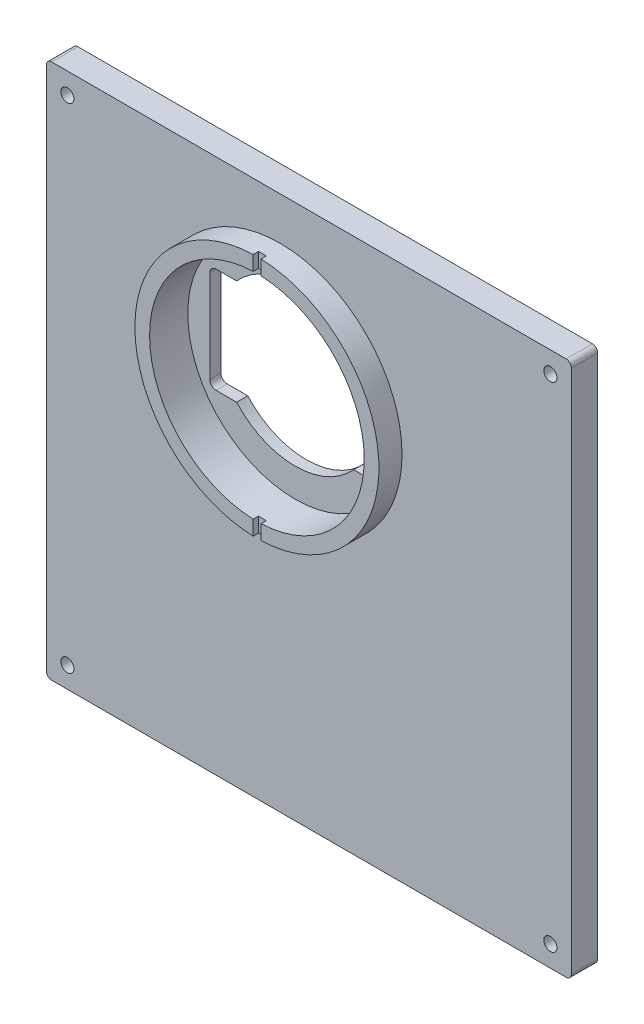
ISO-10303-21;
HEADER;
FILE_DESCRIPTION(('STEP AP214'),'2;1');
FILE_NAME('part.step','',(''),(''),'','','');
FILE_SCHEMA(('AUTOMOTIVE_DESIGN { 1 0 10303 214 1 1 1 1 }'));
ENDSEC;
DATA;
#1=APPLICATION_CONTEXT('core data for automotive mechanical design processes');
#2=APPLICATION_PROTOCOL_DEFINITION('international standard','automotive_design',2000,#1);
#3=PRODUCT_CONTEXT('',#1,'mechanical');
#4=PRODUCT('Part','Part','',(#3));
#5=PRODUCT_RELATED_PRODUCT_CATEGORY('part','',(#4));
#6=PRODUCT_DEFINITION_FORMATION('','',#4);
#7=PRODUCT_DEFINITION_CONTEXT('part definition',#1,'design');
#8=PRODUCT_DEFINITION('design','',#6,#7);
#9=PRODUCT_DEFINITION_SHAPE('','',#8);
#10=(LENGTH_UNIT() NAMED_UNIT(*) SI_UNIT(.MILLI.,.METRE.));
#11=(NAMED_UNIT(*) PLANE_ANGLE_UNIT() SI_UNIT($,.RADIAN.));
#12=(NAMED_UNIT(*) SI_UNIT($,.STERADIAN.) SOLID_ANGLE_UNIT());
#13=UNCERTAINTY_MEASURE_WITH_UNIT(LENGTH_MEASURE(1.E-05),#10,'distance_accuracy_value','');
#14=(GEOMETRIC_REPRESENTATION_CONTEXT(3) GLOBAL_UNCERTAINTY_ASSIGNED_CONTEXT((#13)) GLOBAL_UNIT_ASSIGNED_CONTEXT((#10,
#11,#12)) REPRESENTATION_CONTEXT('',''));
#15=CARTESIAN_POINT('',(0.,0.,0.));
#16=DIRECTION('',(0.,0.,1.));
#17=DIRECTION('',(1.,0.,0.));
#18=AXIS2_PLACEMENT_3D('',#15,#16,#17);
#19=CARTESIAN_POINT('',(0.,0.,11.938));
#20=DIRECTION('',(0.,0.,1.));
#21=DIRECTION('',(1.,0.,0.));
#22=AXIS2_PLACEMENT_3D('',#19,#20,#21);
#23=PLANE('',#22);
#24=DIRECTION('',(0.,1.,0.));
#25=VECTOR('',#24,1.);
#26=CARTESIAN_POINT('',(1.016,-34.114249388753,11.938));
#27=LINE('',#26,#25);
#28=CARTESIAN_POINT('',(1.016,-29.4973077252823,11.938));
#29=VERTEX_POINT('',#28);
#30=CARTESIAN_POINT('',(1.016,-25.9389097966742,11.938));
#31=VERTEX_POINT('',#30);
#32=EDGE_CURVE('E346',#29,#31,#27,.T.);
#33=ORIENTED_EDGE('',*,*,#32,.F.);
#34=CARTESIAN_POINT('',(0.,0.,11.938));
#35=DIRECTION('',(0.,0.,1.));
#36=DIRECTION('',(1.,0.,0.));
#37=AXIS2_PLACEMENT_3D('',#34,#35,#36);
#38=CIRCLE('',#37,29.5148);
#39=CARTESIAN_POINT('',(1.016,29.4973077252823,11.938));
#40=VERTEX_POINT('',#39);
#41=EDGE_CURVE('E242',#29,#40,#38,.T.);
#42=ORIENTED_EDGE('',*,*,#41,.T.);
#43=CARTESIAN_POINT('',(1.016,25.9389097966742,11.938));
#44=VERTEX_POINT('',#43);
#45=EDGE_CURVE('E234',#44,#40,#27,.T.);
#46=ORIENTED_EDGE('',*,*,#45,.F.);
#47=CARTESIAN_POINT('',(0.,0.,11.938));
#48=DIRECTION('',(0.,0.,1.));
#49=DIRECTION('',(1.,0.,0.));
#50=AXIS2_PLACEMENT_3D('',#47,#48,#49);
#51=CIRCLE('',#50,25.9588);
#52=EDGE_CURVE('E438',#31,#44,#51,.T.);
#53=ORIENTED_EDGE('',*,*,#52,.F.);
#54=EDGE_LOOP('',(#33,#42,#46,#53));
#55=FACE_BOUND('',#54,.T.);
#56=ADVANCED_FACE('F31',(#55),#23,.T.);
#57=CARTESIAN_POINT('',(0.,0.,0.));
#58=DIRECTION('',(0.,0.,1.));
#59=DIRECTION('',(1.,0.,0.));
#60=AXIS2_PLACEMENT_3D('',#57,#58,#59);
#61=CYLINDRICAL_SURFACE('',#60,19.0119);
#62=CARTESIAN_POINT('',(0.,0.,2.6924));
#63=DIRECTION('',(0.,0.,1.));
#64=DIRECTION('',(1.,0.,0.));
#65=AXIS2_PLACEMENT_3D('',#62,#63,#64);
#66=CIRCLE('',#65,19.0119);
#67=CARTESIAN_POINT('',(14.1478741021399,12.7,2.6924));
#68=VERTEX_POINT('',#67);
#69=CARTESIAN_POINT('',(-14.1478741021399,12.7,2.6924));
#70=VERTEX_POINT('',#69);
#71=EDGE_CURVE('E431',#68,#70,#66,.T.);
#72=ORIENTED_EDGE('',*,*,#71,.T.);
#73=DIRECTION('',(0.,0.,1.));
#74=VECTOR('',#73,1.);
#75=CARTESIAN_POINT('',(-14.1478741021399,12.7,0.));
#76=LINE('',#75,#74);
#77=CARTESIAN_POINT('',(-14.1478741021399,12.7,0.));
#78=VERTEX_POINT('',#77);
#79=EDGE_CURVE('E322',#70,#78,#76,.F.);
#80=ORIENTED_EDGE('',*,*,#79,.T.);
#81=CARTESIAN_POINT('',(0.,0.,0.));
#82=DIRECTION('',(0.,0.,1.));
#83=DIRECTION('',(1.,0.,0.));
#84=AXIS2_PLACEMENT_3D('',#81,#82,#83);
#85=CIRCLE('',#84,19.0119);
#86=CARTESIAN_POINT('',(14.1478741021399,12.7,0.));
#87=VERTEX_POINT('',#86);
#88=EDGE_CURVE('E435',#87,#78,#85,.T.);
#89=ORIENTED_EDGE('',*,*,#88,.F.);
#90=DIRECTION('',(0.,0.,1.));
#91=VECTOR('',#90,1.);
#92=CARTESIAN_POINT('',(14.1478741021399,12.7,0.));
#93=LINE('',#92,#91);
#94=EDGE_CURVE('E319',#87,#68,#93,.T.);
#95=ORIENTED_EDGE('',*,*,#94,.T.);
#96=EDGE_LOOP('',(#72,#80,#89,#95));
#97=FACE_BOUND('',#96,.T.);
#98=ADVANCED_FACE('F461',(#97),#61,.F.);
#99=CARTESIAN_POINT('',(-55.245,38.608,6.35));
#100=DIRECTION('',(0.,0.,-1.));
#101=DIRECTION('',(-1.,0.,0.));
#102=AXIS2_PLACEMENT_3D('',#99,#100,#101);
#103=CYLINDRICAL_SURFACE('',#102,1.27);
#104=DIRECTION('',(0.,0.,-1.));
#105=VECTOR('',#104,1.);
#106=CARTESIAN_POINT('',(-56.515,38.608,6.35));
#107=LINE('',#106,#105);
#108=CARTESIAN_POINT('',(-56.515,38.608,6.35));
#109=VERTEX_POINT('',#108);
#110=CARTESIAN_POINT('',(-56.515,38.608,0.));
#111=VERTEX_POINT('',#110);
#112=EDGE_CURVE('E311',#109,#111,#107,.T.);
#113=ORIENTED_EDGE('',*,*,#112,.F.);
#114=CARTESIAN_POINT('',(-55.245,38.608,6.35));
#115=DIRECTION('',(0.,0.,1.));
#116=DIRECTION('',(1.,0.,0.));
#117=AXIS2_PLACEMENT_3D('',#114,#115,#116);
#118=CIRCLE('',#117,1.27);
#119=CARTESIAN_POINT('',(-55.245,39.878,6.35));
#120=VERTEX_POINT('',#119);
#121=EDGE_CURVE('E273',#120,#109,#118,.T.);
#122=ORIENTED_EDGE('',*,*,#121,.F.);
#123=DIRECTION('',(0.,0.,-1.));
#124=VECTOR('',#123,1.);
#125=CARTESIAN_POINT('',(-55.245,39.878,6.35));
#126=LINE('',#125,#124);
#127=CARTESIAN_POINT('',(-55.245,39.878,0.));
#128=VERTEX_POINT('',#127);
#129=EDGE_CURVE('E297',#120,#128,#126,.T.);
#130=ORIENTED_EDGE('',*,*,#129,.T.);
#131=CARTESIAN_POINT('',(-55.245,38.608,0.));
#132=DIRECTION('',(0.,0.,1.));
#133=DIRECTION('',(1.,0.,0.));
#134=AXIS2_PLACEMENT_3D('',#131,#132,#133);
#135=CIRCLE('',#134,1.27);
#136=EDGE_CURVE('E241',#128,#111,#135,.T.);
#137=ORIENTED_EDGE('',*,*,#136,.T.);
#138=EDGE_LOOP('',(#113,#122,#130,#137));
#139=FACE_BOUND('',#138,.T.);
#140=ADVANCED_FACE('F466',(#139),#103,.T.);
#141=CARTESIAN_POINT('',(-56.515,38.608,6.35));
#142=DIRECTION('',(1.,0.,0.));
#143=DIRECTION('',(0.,1.,0.));
#144=AXIS2_PLACEMENT_3D('',#141,#142,#143);
#145=PLANE('',#144);
#146=DIRECTION('',(0.,0.,-1.));
#147=VECTOR('',#146,1.);
#148=CARTESIAN_POINT('',(-56.515,-88.392,6.35));
#149=LINE('',#148,#147);
#150=CARTESIAN_POINT('',(-56.515,-88.392,6.35));
#151=VERTEX_POINT('',#150);
#152=CARTESIAN_POINT('',(-56.515,-88.392,0.));
#153=VERTEX_POINT('',#152);
#154=EDGE_CURVE('E309',#151,#153,#149,.T.);
#155=ORIENTED_EDGE('',*,*,#154,.F.);
#156=DIRECTION('',(0.,-1.,0.));
#157=VECTOR('',#156,1.);
#158=CARTESIAN_POINT('',(-56.515,38.608,6.35));
#159=LINE('',#158,#157);
#160=EDGE_CURVE('E276',#109,#151,#159,.T.);
#161=ORIENTED_EDGE('',*,*,#160,.F.);
#162=ORIENTED_EDGE('',*,*,#112,.T.);
#163=DIRECTION('',(0.,-1.,0.));
#164=VECTOR('',#163,1.);
#165=CARTESIAN_POINT('',(-56.515,38.608,0.));
#166=LINE('',#165,#164);
#167=EDGE_CURVE('E245',#111,#153,#166,.T.);
#168=ORIENTED_EDGE('',*,*,#167,.T.);
#169=EDGE_LOOP('',(#155,#161,#162,#168));
#170=FACE_BOUND('',#169,.T.);
#171=ADVANCED_FACE('F33',(#170),#145,.F.);
#172=CARTESIAN_POINT('',(-55.245,-88.392,6.35));
#173=DIRECTION('',(0.,0.,-1.));
#174=DIRECTION('',(-1.,0.,0.));
#175=AXIS2_PLACEMENT_3D('',#172,#173,#174);
#176=CYLINDRICAL_SURFACE('',#175,1.26999999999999);
#177=DIRECTION('',(0.,0.,-1.));
#178=VECTOR('',#177,1.);
#179=CARTESIAN_POINT('',(-55.245,-89.662,6.35));
#180=LINE('',#179,#178);
#181=CARTESIAN_POINT('',(-55.245,-89.662,6.35));
#182=VERTEX_POINT('',#181);
#183=CARTESIAN_POINT('',(-55.245,-89.662,0.));
#184=VERTEX_POINT('',#183);
#185=EDGE_CURVE('E307',#182,#184,#180,.T.);
#186=ORIENTED_EDGE('',*,*,#185,.F.);
#187=CARTESIAN_POINT('',(-55.245,-88.392,6.35));
#188=DIRECTION('',(0.,0.,1.));
#189=DIRECTION('',(1.,0.,0.));
#190=AXIS2_PLACEMENT_3D('',#187,#188,#189);
#191=CIRCLE('',#190,1.26999999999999);
#192=EDGE_CURVE('E279',#151,#182,#191,.T.);
#193=ORIENTED_EDGE('',*,*,#192,.F.);
#194=ORIENTED_EDGE('',*,*,#154,.T.);
#195=CARTESIAN_POINT('',(-55.245,-88.392,0.));
#196=DIRECTION('',(0.,0.,1.));
#197=DIRECTION('',(1.,0.,0.));
#198=AXIS2_PLACEMENT_3D('',#195,#196,#197);
#199=CIRCLE('',#198,1.26999999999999);
#200=EDGE_CURVE('E255',#153,#184,#199,.T.);
#201=ORIENTED_EDGE('',*,*,#200,.T.);
#202=EDGE_LOOP('',(#186,#193,#194,#201));
#203=FACE_BOUND('',#202,.T.);
#204=ADVANCED_FACE('F513',(#203),#176,.T.);
#205=CARTESIAN_POINT('',(-55.245,-89.662,6.35));
#206=DIRECTION('',(0.,1.,0.));
#207=DIRECTION('',(-1.,0.,0.));
#208=AXIS2_PLACEMENT_3D('',#205,#206,#207);
#209=PLANE('',#208);
#210=DIRECTION('',(0.,0.,-1.));
#211=VECTOR('',#210,1.);
#212=CARTESIAN_POINT('',(69.215,-89.662,6.35));
#213=LINE('',#212,#211);
#214=CARTESIAN_POINT('',(69.215,-89.662,6.35));
#215=VERTEX_POINT('',#214);
#216=CARTESIAN_POINT('',(69.215,-89.662,0.));
#217=VERTEX_POINT('',#216);
#218=EDGE_CURVE('E305',#215,#217,#213,.T.);
#219=ORIENTED_EDGE('',*,*,#218,.F.);
#220=DIRECTION('',(1.,0.,0.));
#221=VECTOR('',#220,1.);
#222=CARTESIAN_POINT('',(-55.245,-89.662,6.35));
#223=LINE('',#222,#221);
#224=EDGE_CURVE('E282',#182,#215,#223,.T.);
#225=ORIENTED_EDGE('',*,*,#224,.F.);
#226=ORIENTED_EDGE('',*,*,#185,.T.);
#227=DIRECTION('',(1.,0.,0.));
#228=VECTOR('',#227,1.);
#229=CARTESIAN_POINT('',(-55.245,-89.662,0.));
#230=LINE('',#229,#228);
#231=EDGE_CURVE('E258',#184,#217,#230,.T.);
#232=ORIENTED_EDGE('',*,*,#231,.T.);
#233=EDGE_LOOP('',(#219,#225,#226,#232));
#234=FACE_BOUND('',#233,.T.);
#235=ADVANCED_FACE('F510',(#234),#209,.F.);
#236=CARTESIAN_POINT('',(69.215,-88.392,6.35));
#237=DIRECTION('',(0.,0.,-1.));
#238=DIRECTION('',(-1.,0.,0.));
#239=AXIS2_PLACEMENT_3D('',#236,#237,#238);
#240=CYLINDRICAL_SURFACE('',#239,1.26999999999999);
#241=DIRECTION('',(0.,0.,-1.));
#242=VECTOR('',#241,1.);
#243=CARTESIAN_POINT('',(70.485,-88.392,6.35));
#244=LINE('',#243,#242);
#245=CARTESIAN_POINT('',(70.485,-88.392,6.35));
#246=VERTEX_POINT('',#245);
#247=CARTESIAN_POINT('',(70.485,-88.392,0.));
#248=VERTEX_POINT('',#247);
#249=EDGE_CURVE('E303',#246,#248,#244,.T.);
#250=ORIENTED_EDGE('',*,*,#249,.F.);
#251=CARTESIAN_POINT('',(69.215,-88.392,6.35));
#252=DIRECTION('',(0.,0.,1.));
#253=DIRECTION('',(1.,0.,0.));
#254=AXIS2_PLACEMENT_3D('',#251,#252,#253);
#255=CIRCLE('',#254,1.26999999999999);
#256=EDGE_CURVE('E285',#215,#246,#255,.T.);
#257=ORIENTED_EDGE('',*,*,#256,.F.);
#258=ORIENTED_EDGE('',*,*,#218,.T.);
#259=CARTESIAN_POINT('',(69.215,-88.392,0.));
#260=DIRECTION('',(0.,0.,1.));
#261=DIRECTION('',(1.,0.,0.));
#262=AXIS2_PLACEMENT_3D('',#259,#260,#261);
#263=CIRCLE('',#262,1.26999999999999);
#264=EDGE_CURVE('E261',#217,#248,#263,.T.);
#265=ORIENTED_EDGE('',*,*,#264,.T.);
#266=EDGE_LOOP('',(#250,#257,#258,#265));
#267=FACE_BOUND('',#266,.T.);
#268=ADVANCED_FACE('F506',(#267),#240,.T.);
#269=CARTESIAN_POINT('',(70.485,-88.392,6.35));
#270=DIRECTION('',(-1.,0.,0.));
#271=DIRECTION('',(0.,0.,1.));
#272=AXIS2_PLACEMENT_3D('',#269,#270,#271);
#273=PLANE('',#272);
#274=DIRECTION('',(0.,0.,-1.));
#275=VECTOR('',#274,1.);
#276=CARTESIAN_POINT('',(70.485,38.608,6.35));
#277=LINE('',#276,#275);
#278=CARTESIAN_POINT('',(70.485,38.608,6.35));
#279=VERTEX_POINT('',#278);
#280=CARTESIAN_POINT('',(70.485,38.608,0.));
#281=VERTEX_POINT('',#280);
#282=EDGE_CURVE('E301',#279,#281,#277,.T.);
#283=ORIENTED_EDGE('',*,*,#282,.F.);
#284=DIRECTION('',(0.,1.,0.));
#285=VECTOR('',#284,1.);
#286=CARTESIAN_POINT('',(70.485,-88.392,6.35));
#287=LINE('',#286,#285);
#288=EDGE_CURVE('E288',#246,#279,#287,.T.);
#289=ORIENTED_EDGE('',*,*,#288,.F.);
#290=ORIENTED_EDGE('',*,*,#249,.T.);
#291=DIRECTION('',(0.,1.,0.));
#292=VECTOR('',#291,1.);
#293=CARTESIAN_POINT('',(70.485,-88.392,0.));
#294=LINE('',#293,#292);
#295=EDGE_CURVE('E264',#248,#281,#294,.T.);
#296=ORIENTED_EDGE('',*,*,#295,.T.);
#297=EDGE_LOOP('',(#283,#289,#290,#296));
#298=FACE_BOUND('',#297,.T.);
#299=ADVANCED_FACE('F498',(#298),#273,.F.);
#300=CARTESIAN_POINT('',(69.215,38.608,6.35));
#301=DIRECTION('',(0.,0.,-1.));
#302=DIRECTION('',(-1.,0.,0.));
#303=AXIS2_PLACEMENT_3D('',#300,#301,#302);
#304=CYLINDRICAL_SURFACE('',#303,1.26999999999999);
#305=DIRECTION('',(0.,0.,-1.));
#306=VECTOR('',#305,1.);
#307=CARTESIAN_POINT('',(69.215,39.878,6.35));
#308=LINE('',#307,#306);
#309=CARTESIAN_POINT('',(69.215,39.878,6.35));
#310=VERTEX_POINT('',#309);
#311=CARTESIAN_POINT('',(69.215,39.878,0.));
#312=VERTEX_POINT('',#311);
#313=EDGE_CURVE('E299',#310,#312,#308,.T.);
#314=ORIENTED_EDGE('',*,*,#313,.F.);
#315=CARTESIAN_POINT('',(69.215,38.608,6.35));
#316=DIRECTION('',(0.,0.,1.));
#317=DIRECTION('',(1.,0.,0.));
#318=AXIS2_PLACEMENT_3D('',#315,#316,#317);
#319=CIRCLE('',#318,1.26999999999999);
#320=EDGE_CURVE('E291',#279,#310,#319,.T.);
#321=ORIENTED_EDGE('',*,*,#320,.F.);
#322=ORIENTED_EDGE('',*,*,#282,.T.);
#323=CARTESIAN_POINT('',(69.215,38.608,0.));
#324=DIRECTION('',(0.,0.,1.));
#325=DIRECTION('',(1.,0.,0.));
#326=AXIS2_PLACEMENT_3D('',#323,#324,#325);
#327=CIRCLE('',#326,1.26999999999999);
#328=EDGE_CURVE('E267',#281,#312,#327,.T.);
#329=ORIENTED_EDGE('',*,*,#328,.T.);
#330=EDGE_LOOP('',(#314,#321,#322,#329));
#331=FACE_BOUND('',#330,.T.);
#332=ADVANCED_FACE('F489',(#331),#304,.T.);
#333=CARTESIAN_POINT('',(69.215,39.878,6.35));
#334=DIRECTION('',(0.,-1.,0.));
#335=DIRECTION('',(1.,0.,0.));
#336=AXIS2_PLACEMENT_3D('',#333,#334,#335);
#337=PLANE('',#336);
#338=DIRECTION('',(-1.,0.,0.));
#339=VECTOR('',#338,1.);
#340=CARTESIAN_POINT('',(69.215,39.878,6.35));
#341=LINE('',#340,#339);
#342=EDGE_CURVE('E294',#310,#120,#341,.T.);
#343=ORIENTED_EDGE('',*,*,#342,.F.);
#344=ORIENTED_EDGE('',*,*,#313,.T.);
#345=DIRECTION('',(-1.,0.,0.));
#346=VECTOR('',#345,1.);
#347=CARTESIAN_POINT('',(69.215,39.878,0.));
#348=LINE('',#347,#346);
#349=EDGE_CURVE('E270',#312,#128,#348,.T.);
#350=ORIENTED_EDGE('',*,*,#349,.T.);
#351=ORIENTED_EDGE('',*,*,#129,.F.);
#352=EDGE_LOOP('',(#343,#344,#350,#351));
#353=FACE_BOUND('',#352,.T.);
#354=ADVANCED_FACE('F483',(#353),#337,.F.);
#355=CARTESIAN_POINT('',(-55.245,38.608,6.35));
#356=DIRECTION('',(0.,0.,1.));
#357=DIRECTION('',(1.,0.,0.));
#358=AXIS2_PLACEMENT_3D('',#355,#356,#357);
#359=PLANE('',#358);
#360=CARTESIAN_POINT('',(65.405,34.798,6.35));
#361=DIRECTION('',(0.,0.,1.));
#362=DIRECTION('',(1.,0.,0.));
#363=AXIS2_PLACEMENT_3D('',#360,#361,#362);
#364=CIRCLE('',#363,1.58749999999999);
#365=CARTESIAN_POINT('',(66.9925,34.798,6.35));
#366=VERTEX_POINT('',#365);
#367=EDGE_CURVE('E809',#366,#366,#364,.T.);
#368=ORIENTED_EDGE('',*,*,#367,.F.);
#369=EDGE_LOOP('',(#368));
#370=FACE_BOUND('',#369,.T.);
#371=CARTESIAN_POINT('',(-51.435,34.798,6.35));
#372=DIRECTION('',(0.,0.,1.));
#373=DIRECTION('',(1.,0.,0.));
#374=AXIS2_PLACEMENT_3D('',#371,#372,#373);
#375=CIRCLE('',#374,1.5875);
#376=CARTESIAN_POINT('',(-49.8475,34.798,6.35));
#377=VERTEX_POINT('',#376);
#378=EDGE_CURVE('E811',#377,#377,#375,.T.);
#379=ORIENTED_EDGE('',*,*,#378,.F.);
#380=EDGE_LOOP('',(#379));
#381=FACE_BOUND('',#380,.T.);
#382=CARTESIAN_POINT('',(-51.435,-84.582,6.35));
#383=DIRECTION('',(0.,0.,1.));
#384=DIRECTION('',(1.,0.,0.));
#385=AXIS2_PLACEMENT_3D('',#382,#383,#384);
#386=CIRCLE('',#385,1.5875);
#387=CARTESIAN_POINT('',(-49.8475,-84.582,6.35));
#388=VERTEX_POINT('',#387);
#389=EDGE_CURVE('E819',#388,#388,#386,.T.);
#390=ORIENTED_EDGE('',*,*,#389,.F.);
#391=EDGE_LOOP('',(#390));
#392=FACE_BOUND('',#391,.T.);
#393=CARTESIAN_POINT('',(65.405,-84.582,6.35));
#394=DIRECTION('',(0.,0.,1.));
#395=DIRECTION('',(1.,0.,0.));
#396=AXIS2_PLACEMENT_3D('',#393,#394,#395);
#397=CIRCLE('',#396,1.58749999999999);
#398=CARTESIAN_POINT('',(66.9925,-84.582,6.35));
#399=VERTEX_POINT('',#398);
#400=EDGE_CURVE('E825',#399,#399,#397,.T.);
#401=ORIENTED_EDGE('',*,*,#400,.F.);
#402=EDGE_LOOP('',(#401));
#403=FACE_BOUND('',#402,.T.);
#404=CARTESIAN_POINT('',(0.,0.,6.35));
#405=DIRECTION('',(0.,0.,1.));
#406=DIRECTION('',(1.,0.,0.));
#407=AXIS2_PLACEMENT_3D('',#404,#405,#406);
#408=CIRCLE('',#407,29.5148);
#409=CARTESIAN_POINT('',(29.5148,0.,6.35));
#410=VERTEX_POINT('',#409);
#411=EDGE_CURVE('E250',#410,#410,#408,.T.);
#412=ORIENTED_EDGE('',*,*,#411,.F.);
#413=EDGE_LOOP('',(#412));
#414=FACE_BOUND('',#413,.T.);
#415=ORIENTED_EDGE('',*,*,#121,.T.);
#416=ORIENTED_EDGE('',*,*,#160,.T.);
#417=ORIENTED_EDGE('',*,*,#192,.T.);
#418=ORIENTED_EDGE('',*,*,#224,.T.);
#419=ORIENTED_EDGE('',*,*,#256,.T.);
#420=ORIENTED_EDGE('',*,*,#288,.T.);
#421=ORIENTED_EDGE('',*,*,#320,.T.);
#422=ORIENTED_EDGE('',*,*,#342,.T.);
#423=EDGE_LOOP('',(#415,#416,#417,#418,#419,#420,#421,#422));
#424=FACE_BOUND('',#423,.T.);
#425=ADVANCED_FACE('F480',(#370,#381,#392,#403,#414,#424),#359,.T.);
#426=CARTESIAN_POINT('',(-55.245,38.608,0.));
#427=DIRECTION('',(0.,0.,1.));
#428=DIRECTION('',(1.,0.,0.));
#429=AXIS2_PLACEMENT_3D('',#426,#427,#428);
#430=PLANE('',#429);
#431=CARTESIAN_POINT('',(65.405,34.798,0.));
#432=DIRECTION('',(0.,0.,1.));
#433=DIRECTION('',(1.,0.,0.));
#434=AXIS2_PLACEMENT_3D('',#431,#432,#433);
#435=CIRCLE('',#434,1.58749999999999);
#436=CARTESIAN_POINT('',(66.9925,34.798,0.));
#437=VERTEX_POINT('',#436);
#438=EDGE_CURVE('E806',#437,#437,#435,.T.);
#439=ORIENTED_EDGE('',*,*,#438,.T.);
#440=EDGE_LOOP('',(#439));
#441=FACE_BOUND('',#440,.T.);
#442=CARTESIAN_POINT('',(-51.435,34.798,0.));
#443=DIRECTION('',(0.,0.,1.));
#444=DIRECTION('',(1.,0.,0.));
#445=AXIS2_PLACEMENT_3D('',#442,#443,#444);
#446=CIRCLE('',#445,1.5875);
#447=CARTESIAN_POINT('',(-49.8475,34.798,0.));
#448=VERTEX_POINT('',#447);
#449=EDGE_CURVE('E816',#448,#448,#446,.T.);
#450=ORIENTED_EDGE('',*,*,#449,.T.);
#451=EDGE_LOOP('',(#450));
#452=FACE_BOUND('',#451,.T.);
#453=CARTESIAN_POINT('',(-51.435,-84.582,0.));
#454=DIRECTION('',(0.,0.,1.));
#455=DIRECTION('',(1.,0.,0.));
#456=AXIS2_PLACEMENT_3D('',#453,#454,#455);
#457=CIRCLE('',#456,1.5875);
#458=CARTESIAN_POINT('',(-49.8475,-84.582,0.));
#459=VERTEX_POINT('',#458);
#460=EDGE_CURVE('E822',#459,#459,#457,.T.);
#461=ORIENTED_EDGE('',*,*,#460,.T.);
#462=EDGE_LOOP('',(#461));
#463=FACE_BOUND('',#462,.T.);
#464=CARTESIAN_POINT('',(65.405,-84.582,0.));
#465=DIRECTION('',(0.,0.,1.));
#466=DIRECTION('',(1.,0.,0.));
#467=AXIS2_PLACEMENT_3D('',#464,#465,#466);
#468=CIRCLE('',#467,1.58749999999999);
#469=CARTESIAN_POINT('',(66.9925,-84.582,0.));
#470=VERTEX_POINT('',#469);
#471=EDGE_CURVE('E828',#470,#470,#468,.T.);
#472=ORIENTED_EDGE('',*,*,#471,.T.);
#473=EDGE_LOOP('',(#472));
#474=FACE_BOUND('',#473,.T.);
#475=CARTESIAN_POINT('',(19.1008,11.176,0.));
#476=DIRECTION('',(0.,0.,-1.));
#477=DIRECTION('',(-1.,0.,0.));
#478=AXIS2_PLACEMENT_3D('',#475,#476,#477);
#479=CIRCLE('',#478,1.524);
#480=CARTESIAN_POINT('',(19.1008,12.7,0.));
#481=VERTEX_POINT('',#480);
#482=CARTESIAN_POINT('',(20.6248,11.176,0.));
#483=VERTEX_POINT('',#482);
#484=EDGE_CURVE('E393',#481,#483,#479,.T.);
#485=ORIENTED_EDGE('',*,*,#484,.F.);
#486=DIRECTION('',(-1.,0.,0.));
#487=VECTOR('',#486,1.);
#488=CARTESIAN_POINT('',(19.1008,12.7,0.));
#489=LINE('',#488,#487);
#490=EDGE_CURVE('E390',#481,#87,#489,.T.);
#491=ORIENTED_EDGE('',*,*,#490,.T.);
#492=ORIENTED_EDGE('',*,*,#88,.T.);
#493=CARTESIAN_POINT('',(-19.1262,12.7,0.));
#494=VERTEX_POINT('',#493);
#495=EDGE_CURVE('E389',#78,#494,#489,.T.);
#496=ORIENTED_EDGE('',*,*,#495,.T.);
#497=CARTESIAN_POINT('',(-19.1262,11.176,0.));
#498=DIRECTION('',(0.,0.,-1.));
#499=DIRECTION('',(-1.,0.,0.));
#500=AXIS2_PLACEMENT_3D('',#497,#498,#499);
#501=CIRCLE('',#500,1.524);
#502=CARTESIAN_POINT('',(-20.6502,11.176,0.));
#503=VERTEX_POINT('',#502);
#504=EDGE_CURVE('E386',#503,#494,#501,.T.);
#505=ORIENTED_EDGE('',*,*,#504,.F.);
#506=DIRECTION('',(0.,-1.,0.));
#507=VECTOR('',#506,1.);
#508=CARTESIAN_POINT('',(-20.6502,11.176,0.));
#509=LINE('',#508,#507);
#510=CARTESIAN_POINT('',(-20.6502,-11.176,0.));
#511=VERTEX_POINT('',#510);
#512=EDGE_CURVE('E409',#503,#511,#509,.T.);
#513=ORIENTED_EDGE('',*,*,#512,.T.);
#514=CARTESIAN_POINT('',(-19.1262,-11.176,0.));
#515=DIRECTION('',(0.,0.,-1.));
#516=DIRECTION('',(-1.,0.,0.));
#517=AXIS2_PLACEMENT_3D('',#514,#515,#516);
#518=CIRCLE('',#517,1.524);
#519=CARTESIAN_POINT('',(-19.1262,-12.7,0.));
#520=VERTEX_POINT('',#519);
#521=EDGE_CURVE('E406',#520,#511,#518,.T.);
#522=ORIENTED_EDGE('',*,*,#521,.F.);
#523=DIRECTION('',(1.,0.,0.));
#524=VECTOR('',#523,1.);
#525=CARTESIAN_POINT('',(-19.1262,-12.7,0.));
#526=LINE('',#525,#524);
#527=CARTESIAN_POINT('',(-14.1478741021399,-12.7,0.));
#528=VERTEX_POINT('',#527);
#529=EDGE_CURVE('E403',#520,#528,#526,.T.);
#530=ORIENTED_EDGE('',*,*,#529,.T.);
#531=CARTESIAN_POINT('',(14.1478741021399,-12.7,0.));
#532=VERTEX_POINT('',#531);
#533=EDGE_CURVE('E434',#528,#532,#85,.T.);
#534=ORIENTED_EDGE('',*,*,#533,.T.);
#535=CARTESIAN_POINT('',(19.1008,-12.7,0.));
#536=VERTEX_POINT('',#535);
#537=EDGE_CURVE('E402',#532,#536,#526,.T.);
#538=ORIENTED_EDGE('',*,*,#537,.T.);
#539=CARTESIAN_POINT('',(19.1008,-11.176,0.));
#540=DIRECTION('',(0.,0.,-1.));
#541=DIRECTION('',(-1.,0.,0.));
#542=AXIS2_PLACEMENT_3D('',#539,#540,#541);
#543=CIRCLE('',#542,1.524);
#544=CARTESIAN_POINT('',(20.6248,-11.176,0.));
#545=VERTEX_POINT('',#544);
#546=EDGE_CURVE('E399',#545,#536,#543,.T.);
#547=ORIENTED_EDGE('',*,*,#546,.F.);
#548=DIRECTION('',(0.,1.,0.));
#549=VECTOR('',#548,1.);
#550=CARTESIAN_POINT('',(20.6248,-11.176,0.));
#551=LINE('',#550,#549);
#552=EDGE_CURVE('E396',#545,#483,#551,.T.);
#553=ORIENTED_EDGE('',*,*,#552,.T.);
#554=EDGE_LOOP('',(#485,#491,#492,#496,#505,#513,#522,#530,#534,#538,#547,#553));
#555=FACE_BOUND('',#554,.T.);
#556=ORIENTED_EDGE('',*,*,#136,.F.);
#557=ORIENTED_EDGE('',*,*,#349,.F.);
#558=ORIENTED_EDGE('',*,*,#328,.F.);
#559=ORIENTED_EDGE('',*,*,#295,.F.);
#560=ORIENTED_EDGE('',*,*,#264,.F.);
#561=ORIENTED_EDGE('',*,*,#231,.F.);
#562=ORIENTED_EDGE('',*,*,#200,.F.);
#563=ORIENTED_EDGE('',*,*,#167,.F.);
#564=EDGE_LOOP('',(#556,#557,#558,#559,#560,#561,#562,#563));
#565=FACE_BOUND('',#564,.T.);
#566=ADVANCED_FACE('F473',(#441,#452,#463,#474,#555,#565),#430,.F.);
#567=CARTESIAN_POINT('',(0.,0.,11.938));
#568=DIRECTION('',(0.,0.,-1.));
#569=DIRECTION('',(-1.,0.,0.));
#570=AXIS2_PLACEMENT_3D('',#567,#568,#569);
#571=CYLINDRICAL_SURFACE('',#570,29.5148);
#572=CARTESIAN_POINT('',(0.,0.,10.668));
#573=DIRECTION('',(0.,0.,-1.));
#574=DIRECTION('',(-1.,0.,0.));
#575=AXIS2_PLACEMENT_3D('',#572,#573,#574);
#576=CIRCLE('',#575,29.5148);
#577=CARTESIAN_POINT('',(-0.888999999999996,29.5014084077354,10.668));
#578=VERTEX_POINT('',#577);
#579=CARTESIAN_POINT('',(1.016,29.4973077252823,10.668));
#580=VERTEX_POINT('',#579);
#581=EDGE_CURVE('E355',#578,#580,#576,.T.);
#582=ORIENTED_EDGE('',*,*,#581,.T.);
#583=DIRECTION('',(0.,0.,-1.));
#584=VECTOR('',#583,1.);
#585=CARTESIAN_POINT('',(1.016,29.4973077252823,11.938));
#586=LINE('',#585,#584);
#587=EDGE_CURVE('E223',#580,#40,#586,.F.);
#588=ORIENTED_EDGE('',*,*,#587,.T.);
#589=ORIENTED_EDGE('',*,*,#41,.F.);
#590=DIRECTION('',(0.,0.,-1.));
#591=VECTOR('',#590,1.);
#592=CARTESIAN_POINT('',(1.016,-29.4973077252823,11.938));
#593=LINE('',#592,#591);
#594=CARTESIAN_POINT('',(1.016,-29.4973077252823,10.668));
#595=VERTEX_POINT('',#594);
#596=EDGE_CURVE('E359',#29,#595,#593,.T.);
#597=ORIENTED_EDGE('',*,*,#596,.T.);
#598=CARTESIAN_POINT('',(-0.889000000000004,-29.5014084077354,10.668));
#599=VERTEX_POINT('',#598);
#600=EDGE_CURVE('E353',#595,#599,#576,.T.);
#601=ORIENTED_EDGE('',*,*,#600,.T.);
#602=DIRECTION('',(0.,0.,-1.));
#603=VECTOR('',#602,1.);
#604=CARTESIAN_POINT('',(-0.889000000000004,-29.5014084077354,11.938));
#605=LINE('',#604,#603);
#606=CARTESIAN_POINT('',(-0.889000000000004,-29.5014084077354,11.938));
#607=VERTEX_POINT('',#606);
#608=EDGE_CURVE('E224',#599,#607,#605,.F.);
#609=ORIENTED_EDGE('',*,*,#608,.T.);
#610=CARTESIAN_POINT('',(-0.888999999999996,29.5014084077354,11.938));
#611=VERTEX_POINT('',#610);
#612=EDGE_CURVE('E231',#611,#607,#38,.T.);
#613=ORIENTED_EDGE('',*,*,#612,.F.);
#614=DIRECTION('',(0.,0.,-1.));
#615=VECTOR('',#614,1.);
#616=CARTESIAN_POINT('',(-0.888999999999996,29.5014084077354,11.938));
#617=LINE('',#616,#615);
#618=EDGE_CURVE('E215',#611,#578,#617,.T.);
#619=ORIENTED_EDGE('',*,*,#618,.T.);
#620=EDGE_LOOP('',(#582,#588,#589,#597,#601,#609,#613,#619));
#621=FACE_BOUND('',#620,.T.);
#622=ORIENTED_EDGE('',*,*,#411,.T.);
#623=EDGE_LOOP('',(#622));
#624=FACE_BOUND('',#623,.T.);
#625=ADVANCED_FACE('F238',(#621,#624),#571,.T.);
#626=DIRECTION('',(0.,-1.,0.));
#627=VECTOR('',#626,1.);
#628=CARTESIAN_POINT('',(-0.888999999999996,35.3372583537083,11.938));
#629=LINE('',#628,#627);
#630=CARTESIAN_POINT('',(-0.888999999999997,25.9435729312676,11.938));
#631=VERTEX_POINT('',#630);
#632=EDGE_CURVE('E218',#611,#631,#629,.T.);
#633=ORIENTED_EDGE('',*,*,#632,.F.);
#634=ORIENTED_EDGE('',*,*,#612,.T.);
#635=CARTESIAN_POINT('',(-0.889000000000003,-25.9435729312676,11.938));
#636=VERTEX_POINT('',#635);
#637=EDGE_CURVE('E235',#636,#607,#629,.T.);
#638=ORIENTED_EDGE('',*,*,#637,.F.);
#639=EDGE_CURVE('E233',#631,#636,#51,.T.);
#640=ORIENTED_EDGE('',*,*,#639,.F.);
#641=EDGE_LOOP('',(#633,#634,#638,#640));
#642=FACE_BOUND('',#641,.T.);
#643=ADVANCED_FACE('F229',(#642),#23,.T.);
#644=CARTESIAN_POINT('',(0.,0.,2.6924));
#645=DIRECTION('',(0.,0.,1.));
#646=DIRECTION('',(1.,0.,0.));
#647=AXIS2_PLACEMENT_3D('',#644,#645,#646);
#648=CYLINDRICAL_SURFACE('',#647,25.9588);
#649=CARTESIAN_POINT('',(0.,0.,10.668));
#650=DIRECTION('',(0.,0.,-1.));
#651=DIRECTION('',(-1.,0.,0.));
#652=AXIS2_PLACEMENT_3D('',#649,#650,#651);
#653=CIRCLE('',#652,25.9588);
#654=CARTESIAN_POINT('',(-0.889000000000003,-25.9435729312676,10.668));
#655=VERTEX_POINT('',#654);
#656=CARTESIAN_POINT('',(1.016,-25.9389097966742,10.668));
#657=VERTEX_POINT('',#656);
#658=EDGE_CURVE('E329',#655,#657,#653,.F.);
#659=ORIENTED_EDGE('',*,*,#658,.T.);
#660=DIRECTION('',(0.,0.,1.));
#661=VECTOR('',#660,1.);
#662=CARTESIAN_POINT('',(1.016,-25.9389097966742,2.6924));
#663=LINE('',#662,#661);
#664=EDGE_CURVE('E11',#657,#31,#663,.T.);
#665=ORIENTED_EDGE('',*,*,#664,.T.);
#666=ORIENTED_EDGE('',*,*,#52,.T.);
#667=DIRECTION('',(0.,0.,1.));
#668=VECTOR('',#667,1.);
#669=CARTESIAN_POINT('',(1.016,25.9389097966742,2.6924));
#670=LINE('',#669,#668);
#671=CARTESIAN_POINT('',(1.016,25.9389097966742,10.668));
#672=VERTEX_POINT('',#671);
#673=EDGE_CURVE('E331',#44,#672,#670,.F.);
#674=ORIENTED_EDGE('',*,*,#673,.T.);
#675=CARTESIAN_POINT('',(-0.888999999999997,25.9435729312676,10.668));
#676=VERTEX_POINT('',#675);
#677=EDGE_CURVE('E325',#672,#676,#653,.F.);
#678=ORIENTED_EDGE('',*,*,#677,.T.);
#679=DIRECTION('',(0.,0.,1.));
#680=VECTOR('',#679,1.);
#681=CARTESIAN_POINT('',(-0.888999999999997,25.9435729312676,2.6924));
#682=LINE('',#681,#680);
#683=EDGE_CURVE('E328',#676,#631,#682,.T.);
#684=ORIENTED_EDGE('',*,*,#683,.T.);
#685=ORIENTED_EDGE('',*,*,#639,.T.);
#686=DIRECTION('',(0.,0.,1.));
#687=VECTOR('',#686,1.);
#688=CARTESIAN_POINT('',(-0.889000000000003,-25.9435729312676,2.6924));
#689=LINE('',#688,#687);
#690=EDGE_CURVE('E39',#636,#655,#689,.F.);
#691=ORIENTED_EDGE('',*,*,#690,.T.);
#692=EDGE_LOOP('',(#659,#665,#666,#674,#678,#684,#685,#691));
#693=FACE_BOUND('',#692,.T.);
#694=CARTESIAN_POINT('',(0.,0.,2.6924));
#695=DIRECTION('',(0.,0.,1.));
#696=DIRECTION('',(1.,0.,0.));
#697=AXIS2_PLACEMENT_3D('',#694,#695,#696);
#698=CIRCLE('',#697,25.9588);
#699=CARTESIAN_POINT('',(25.9588,0.,2.6924));
#700=VERTEX_POINT('',#699);
#701=EDGE_CURVE('E248',#700,#700,#698,.T.);
#702=ORIENTED_EDGE('',*,*,#701,.F.);
#703=EDGE_LOOP('',(#702));
#704=FACE_BOUND('',#703,.T.);
#705=ADVANCED_FACE('F336',(#693,#704),#648,.F.);
#706=CARTESIAN_POINT('',(0.,0.,2.6924));
#707=DIRECTION('',(0.,0.,1.));
#708=DIRECTION('',(1.,0.,0.));
#709=AXIS2_PLACEMENT_3D('',#706,#707,#708);
#710=PLANE('',#709);
#711=DIRECTION('',(-1.,0.,0.));
#712=VECTOR('',#711,1.);
#713=CARTESIAN_POINT('',(19.1008,12.7,2.6924));
#714=LINE('',#713,#712);
#715=CARTESIAN_POINT('',(19.1008,12.7,2.6924));
#716=VERTEX_POINT('',#715);
#717=EDGE_CURVE('E366',#716,#68,#714,.T.);
#718=ORIENTED_EDGE('',*,*,#717,.F.);
#719=CARTESIAN_POINT('',(19.1008,11.176,2.6924));
#720=DIRECTION('',(0.,0.,-1.));
#721=DIRECTION('',(-1.,0.,0.));
#722=AXIS2_PLACEMENT_3D('',#719,#720,#721);
#723=CIRCLE('',#722,1.524);
#724=CARTESIAN_POINT('',(20.6248,11.176,2.6924));
#725=VERTEX_POINT('',#724);
#726=EDGE_CURVE('E368',#716,#725,#723,.T.);
#727=ORIENTED_EDGE('',*,*,#726,.T.);
#728=DIRECTION('',(0.,1.,0.));
#729=VECTOR('',#728,1.);
#730=CARTESIAN_POINT('',(20.6248,-11.176,2.6924));
#731=LINE('',#730,#729);
#732=CARTESIAN_POINT('',(20.6248,-11.176,2.6924));
#733=VERTEX_POINT('',#732);
#734=EDGE_CURVE('E371',#733,#725,#731,.T.);
#735=ORIENTED_EDGE('',*,*,#734,.F.);
#736=CARTESIAN_POINT('',(19.1008,-11.176,2.6924));
#737=DIRECTION('',(0.,0.,-1.));
#738=DIRECTION('',(-1.,0.,0.));
#739=AXIS2_PLACEMENT_3D('',#736,#737,#738);
#740=CIRCLE('',#739,1.524);
#741=CARTESIAN_POINT('',(19.1008,-12.7,2.6924));
#742=VERTEX_POINT('',#741);
#743=EDGE_CURVE('E374',#733,#742,#740,.T.);
#744=ORIENTED_EDGE('',*,*,#743,.T.);
#745=DIRECTION('',(1.,0.,0.));
#746=VECTOR('',#745,1.);
#747=CARTESIAN_POINT('',(-19.1262,-12.7,2.6924));
#748=LINE('',#747,#746);
#749=CARTESIAN_POINT('',(14.1478741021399,-12.7,2.6924));
#750=VERTEX_POINT('',#749);
#751=EDGE_CURVE('E377',#750,#742,#748,.T.);
#752=ORIENTED_EDGE('',*,*,#751,.F.);
#753=CARTESIAN_POINT('',(-14.1478741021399,-12.7,2.6924));
#754=VERTEX_POINT('',#753);
#755=EDGE_CURVE('E430',#754,#750,#66,.T.);
#756=ORIENTED_EDGE('',*,*,#755,.F.);
#757=CARTESIAN_POINT('',(-19.1262,-12.7,2.6924));
#758=VERTEX_POINT('',#757);
#759=EDGE_CURVE('E378',#758,#754,#748,.T.);
#760=ORIENTED_EDGE('',*,*,#759,.F.);
#761=CARTESIAN_POINT('',(-19.1262,-11.176,2.6924));
#762=DIRECTION('',(0.,0.,-1.));
#763=DIRECTION('',(-1.,0.,0.));
#764=AXIS2_PLACEMENT_3D('',#761,#762,#763);
#765=CIRCLE('',#764,1.524);
#766=CARTESIAN_POINT('',(-20.6502,-11.176,2.6924));
#767=VERTEX_POINT('',#766);
#768=EDGE_CURVE('E380',#758,#767,#765,.T.);
#769=ORIENTED_EDGE('',*,*,#768,.T.);
#770=DIRECTION('',(0.,-1.,0.));
#771=VECTOR('',#770,1.);
#772=CARTESIAN_POINT('',(-20.6502,11.176,2.6924));
#773=LINE('',#772,#771);
#774=CARTESIAN_POINT('',(-20.6502,11.176,2.6924));
#775=VERTEX_POINT('',#774);
#776=EDGE_CURVE('E383',#775,#767,#773,.T.);
#777=ORIENTED_EDGE('',*,*,#776,.F.);
#778=CARTESIAN_POINT('',(-19.1262,11.176,2.6924));
#779=DIRECTION('',(0.,0.,-1.));
#780=DIRECTION('',(-1.,0.,0.));
#781=AXIS2_PLACEMENT_3D('',#778,#779,#780);
#782=CIRCLE('',#781,1.524);
#783=CARTESIAN_POINT('',(-19.1262,12.7,2.6924));
#784=VERTEX_POINT('',#783);
#785=EDGE_CURVE('E362',#775,#784,#782,.T.);
#786=ORIENTED_EDGE('',*,*,#785,.T.);
#787=EDGE_CURVE('E365',#70,#784,#714,.T.);
#788=ORIENTED_EDGE('',*,*,#787,.F.);
#789=ORIENTED_EDGE('',*,*,#71,.F.);
#790=EDGE_LOOP('',(#718,#727,#735,#744,#752,#756,#760,#769,#777,#786,#788,#789));
#791=FACE_BOUND('',#790,.T.);
#792=ORIENTED_EDGE('',*,*,#701,.T.);
#793=EDGE_LOOP('',(#792));
#794=FACE_BOUND('',#793,.T.);
#795=ADVANCED_FACE('F478',(#791,#794),#710,.T.);
#796=ORIENTED_EDGE('',*,*,#755,.T.);
#797=DIRECTION('',(0.,0.,1.));
#798=VECTOR('',#797,1.);
#799=CARTESIAN_POINT('',(14.1478741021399,-12.7,0.));
#800=LINE('',#799,#798);
#801=EDGE_CURVE('E316',#750,#532,#800,.F.);
#802=ORIENTED_EDGE('',*,*,#801,.T.);
#803=ORIENTED_EDGE('',*,*,#533,.F.);
#804=DIRECTION('',(0.,0.,1.));
#805=VECTOR('',#804,1.);
#806=CARTESIAN_POINT('',(-14.1478741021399,-12.7,0.));
#807=LINE('',#806,#805);
#808=EDGE_CURVE('E313',#528,#754,#807,.T.);
#809=ORIENTED_EDGE('',*,*,#808,.T.);
#810=EDGE_LOOP('',(#796,#802,#803,#809));
#811=FACE_BOUND('',#810,.T.);
#812=ADVANCED_FACE('F469',(#811),#61,.F.);
#813=CARTESIAN_POINT('',(-19.1262,-12.7,0.));
#814=DIRECTION('',(0.,-1.,0.));
#815=DIRECTION('',(1.,0.,0.));
#816=AXIS2_PLACEMENT_3D('',#813,#814,#815);
#817=PLANE('',#816);
#818=ORIENTED_EDGE('',*,*,#529,.F.);
#819=DIRECTION('',(0.,0.,1.));
#820=VECTOR('',#819,1.);
#821=CARTESIAN_POINT('',(-19.1262,-12.7,0.));
#822=LINE('',#821,#820);
#823=EDGE_CURVE('E416',#520,#758,#822,.T.);
#824=ORIENTED_EDGE('',*,*,#823,.T.);
#825=ORIENTED_EDGE('',*,*,#759,.T.);
#826=ORIENTED_EDGE('',*,*,#808,.F.);
#827=EDGE_LOOP('',(#818,#824,#825,#826));
#828=FACE_BOUND('',#827,.T.);
#829=ADVANCED_FACE('F624',(#828),#817,.F.);
#830=CARTESIAN_POINT('',(-20.6502,11.176,0.));
#831=DIRECTION('',(-1.,0.,0.));
#832=DIRECTION('',(0.,-1.,0.));
#833=AXIS2_PLACEMENT_3D('',#830,#831,#832);
#834=PLANE('',#833);
#835=ORIENTED_EDGE('',*,*,#512,.F.);
#836=DIRECTION('',(0.,0.,1.));
#837=VECTOR('',#836,1.);
#838=CARTESIAN_POINT('',(-20.6502,11.176,0.));
#839=LINE('',#838,#837);
#840=EDGE_CURVE('E412',#503,#775,#839,.T.);
#841=ORIENTED_EDGE('',*,*,#840,.T.);
#842=ORIENTED_EDGE('',*,*,#776,.T.);
#843=DIRECTION('',(0.,0.,1.));
#844=VECTOR('',#843,1.);
#845=CARTESIAN_POINT('',(-20.6502,-11.176,0.));
#846=LINE('',#845,#844);
#847=EDGE_CURVE('E414',#511,#767,#846,.T.);
#848=ORIENTED_EDGE('',*,*,#847,.F.);
#849=EDGE_LOOP('',(#835,#841,#842,#848));
#850=FACE_BOUND('',#849,.T.);
#851=ADVANCED_FACE('F634',(#850),#834,.F.);
#852=CARTESIAN_POINT('',(-19.1262,-11.176,0.));
#853=DIRECTION('',(0.,0.,1.));
#854=DIRECTION('',(1.,0.,0.));
#855=AXIS2_PLACEMENT_3D('',#852,#853,#854);
#856=CYLINDRICAL_SURFACE('',#855,1.524);
#857=ORIENTED_EDGE('',*,*,#847,.T.);
#858=ORIENTED_EDGE('',*,*,#768,.F.);
#859=ORIENTED_EDGE('',*,*,#823,.F.);
#860=ORIENTED_EDGE('',*,*,#521,.T.);
#861=EDGE_LOOP('',(#857,#858,#859,#860));
#862=FACE_BOUND('',#861,.T.);
#863=ADVANCED_FACE('F645',(#862),#856,.F.);
#864=CARTESIAN_POINT('',(19.1008,12.7,0.));
#865=DIRECTION('',(0.,1.,0.));
#866=DIRECTION('',(-1.,0.,0.));
#867=AXIS2_PLACEMENT_3D('',#864,#865,#866);
#868=PLANE('',#867);
#869=ORIENTED_EDGE('',*,*,#787,.T.);
#870=DIRECTION('',(0.,0.,1.));
#871=VECTOR('',#870,1.);
#872=CARTESIAN_POINT('',(-19.1262,12.7,0.));
#873=LINE('',#872,#871);
#874=EDGE_CURVE('E427',#494,#784,#873,.T.);
#875=ORIENTED_EDGE('',*,*,#874,.F.);
#876=ORIENTED_EDGE('',*,*,#495,.F.);
#877=ORIENTED_EDGE('',*,*,#79,.F.);
#878=EDGE_LOOP('',(#869,#875,#876,#877));
#879=FACE_BOUND('',#878,.T.);
#880=ADVANCED_FACE('F655',(#879),#868,.F.);
#881=CARTESIAN_POINT('',(-19.1262,11.176,0.));
#882=DIRECTION('',(0.,0.,1.));
#883=DIRECTION('',(1.,0.,0.));
#884=AXIS2_PLACEMENT_3D('',#881,#882,#883);
#885=CYLINDRICAL_SURFACE('',#884,1.524);
#886=ORIENTED_EDGE('',*,*,#874,.T.);
#887=ORIENTED_EDGE('',*,*,#785,.F.);
#888=ORIENTED_EDGE('',*,*,#840,.F.);
#889=ORIENTED_EDGE('',*,*,#504,.T.);
#890=EDGE_LOOP('',(#886,#887,#888,#889));
#891=FACE_BOUND('',#890,.T.);
#892=ADVANCED_FACE('F665',(#891),#885,.F.);
#893=ORIENTED_EDGE('',*,*,#490,.F.);
#894=DIRECTION('',(0.,0.,1.));
#895=VECTOR('',#894,1.);
#896=CARTESIAN_POINT('',(19.1008,12.7,0.));
#897=LINE('',#896,#895);
#898=EDGE_CURVE('E425',#481,#716,#897,.T.);
#899=ORIENTED_EDGE('',*,*,#898,.T.);
#900=ORIENTED_EDGE('',*,*,#717,.T.);
#901=ORIENTED_EDGE('',*,*,#94,.F.);
#902=EDGE_LOOP('',(#893,#899,#900,#901));
#903=FACE_BOUND('',#902,.T.);
#904=ADVANCED_FACE('F668',(#903),#868,.F.);
#905=ORIENTED_EDGE('',*,*,#751,.T.);
#906=DIRECTION('',(0.,0.,1.));
#907=VECTOR('',#906,1.);
#908=CARTESIAN_POINT('',(19.1008,-12.7,0.));
#909=LINE('',#908,#907);
#910=EDGE_CURVE('E418',#536,#742,#909,.T.);
#911=ORIENTED_EDGE('',*,*,#910,.F.);
#912=ORIENTED_EDGE('',*,*,#537,.F.);
#913=ORIENTED_EDGE('',*,*,#801,.F.);
#914=EDGE_LOOP('',(#905,#911,#912,#913));
#915=FACE_BOUND('',#914,.T.);
#916=ADVANCED_FACE('F637',(#915),#817,.F.);
#917=CARTESIAN_POINT('',(19.1008,11.176,0.));
#918=DIRECTION('',(0.,0.,1.));
#919=DIRECTION('',(1.,0.,0.));
#920=AXIS2_PLACEMENT_3D('',#917,#918,#919);
#921=CYLINDRICAL_SURFACE('',#920,1.524);
#922=DIRECTION('',(0.,0.,1.));
#923=VECTOR('',#922,1.);
#924=CARTESIAN_POINT('',(20.6248,11.176,0.));
#925=LINE('',#924,#923);
#926=EDGE_CURVE('E423',#483,#725,#925,.T.);
#927=ORIENTED_EDGE('',*,*,#926,.T.);
#928=ORIENTED_EDGE('',*,*,#726,.F.);
#929=ORIENTED_EDGE('',*,*,#898,.F.);
#930=ORIENTED_EDGE('',*,*,#484,.T.);
#931=EDGE_LOOP('',(#927,#928,#929,#930));
#932=FACE_BOUND('',#931,.T.);
#933=ADVANCED_FACE('F692',(#932),#921,.F.);
#934=CARTESIAN_POINT('',(20.6248,-11.176,0.));
#935=DIRECTION('',(1.,0.,0.));
#936=DIRECTION('',(0.,1.,0.));
#937=AXIS2_PLACEMENT_3D('',#934,#935,#936);
#938=PLANE('',#937);
#939=DIRECTION('',(0.,0.,1.));
#940=VECTOR('',#939,1.);
#941=CARTESIAN_POINT('',(20.6248,-11.176,0.));
#942=LINE('',#941,#940);
#943=EDGE_CURVE('E421',#545,#733,#942,.T.);
#944=ORIENTED_EDGE('',*,*,#943,.T.);
#945=ORIENTED_EDGE('',*,*,#734,.T.);
#946=ORIENTED_EDGE('',*,*,#926,.F.);
#947=ORIENTED_EDGE('',*,*,#552,.F.);
#948=EDGE_LOOP('',(#944,#945,#946,#947));
#949=FACE_BOUND('',#948,.T.);
#950=ADVANCED_FACE('F701',(#949),#938,.F.);
#951=CARTESIAN_POINT('',(19.1008,-11.176,0.));
#952=DIRECTION('',(0.,0.,1.));
#953=DIRECTION('',(1.,0.,0.));
#954=AXIS2_PLACEMENT_3D('',#951,#952,#953);
#955=CYLINDRICAL_SURFACE('',#954,1.524);
#956=ORIENTED_EDGE('',*,*,#910,.T.);
#957=ORIENTED_EDGE('',*,*,#743,.F.);
#958=ORIENTED_EDGE('',*,*,#943,.F.);
#959=ORIENTED_EDGE('',*,*,#546,.T.);
#960=EDGE_LOOP('',(#956,#957,#958,#959));
#961=FACE_BOUND('',#960,.T.);
#962=ADVANCED_FACE('F711',(#961),#955,.F.);
#963=CARTESIAN_POINT('',(1.016,35.3372583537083,10.668));
#964=DIRECTION('',(0.,0.,-1.));
#965=DIRECTION('',(-1.,0.,0.));
#966=AXIS2_PLACEMENT_3D('',#963,#964,#965);
#967=PLANE('',#966);
#968=DIRECTION('',(0.,-1.,0.));
#969=VECTOR('',#968,1.);
#970=CARTESIAN_POINT('',(-0.888999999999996,35.3372583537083,10.668));
#971=LINE('',#970,#969);
#972=EDGE_CURVE('E54',#578,#676,#971,.T.);
#973=ORIENTED_EDGE('',*,*,#972,.T.);
#974=ORIENTED_EDGE('',*,*,#677,.F.);
#975=DIRECTION('',(0.,1.,0.));
#976=VECTOR('',#975,1.);
#977=CARTESIAN_POINT('',(1.016,-34.114249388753,10.668));
#978=LINE('',#977,#976);
#979=EDGE_CURVE('E348',#672,#580,#978,.T.);
#980=ORIENTED_EDGE('',*,*,#979,.T.);
#981=ORIENTED_EDGE('',*,*,#581,.F.);
#982=EDGE_LOOP('',(#973,#974,#980,#981));
#983=FACE_BOUND('',#982,.T.);
#984=ADVANCED_FACE('F443',(#983),#967,.F.);
#985=CARTESIAN_POINT('',(-0.888999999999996,35.3372583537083,10.668));
#986=DIRECTION('',(-1.,0.,0.));
#987=DIRECTION('',(0.,-1.,0.));
#988=AXIS2_PLACEMENT_3D('',#985,#986,#987);
#989=PLANE('',#988);
#990=ORIENTED_EDGE('',*,*,#632,.T.);
#991=ORIENTED_EDGE('',*,*,#683,.F.);
#992=ORIENTED_EDGE('',*,*,#972,.F.);
#993=ORIENTED_EDGE('',*,*,#618,.F.);
#994=EDGE_LOOP('',(#990,#991,#992,#993));
#995=FACE_BOUND('',#994,.T.);
#996=ADVANCED_FACE('F217',(#995),#989,.F.);
#997=CARTESIAN_POINT('',(1.016,-34.114249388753,10.668));
#998=DIRECTION('',(1.,0.,0.));
#999=DIRECTION('',(0.,0.,-1.));
#1000=AXIS2_PLACEMENT_3D('',#997,#998,#999);
#1001=PLANE('',#1000);
#1002=ORIENTED_EDGE('',*,*,#979,.F.);
#1003=ORIENTED_EDGE('',*,*,#673,.F.);
#1004=ORIENTED_EDGE('',*,*,#45,.T.);
#1005=ORIENTED_EDGE('',*,*,#587,.F.);
#1006=EDGE_LOOP('',(#1002,#1003,#1004,#1005));
#1007=FACE_BOUND('',#1006,.T.);
#1008=ADVANCED_FACE('F445',(#1007),#1001,.F.);
#1009=ORIENTED_EDGE('',*,*,#32,.T.);
#1010=ORIENTED_EDGE('',*,*,#664,.F.);
#1011=EDGE_CURVE('E46',#595,#657,#978,.T.);
#1012=ORIENTED_EDGE('',*,*,#1011,.F.);
#1013=ORIENTED_EDGE('',*,*,#596,.F.);
#1014=EDGE_LOOP('',(#1009,#1010,#1012,#1013));
#1015=FACE_BOUND('',#1014,.T.);
#1016=ADVANCED_FACE('F451',(#1015),#1001,.F.);
#1017=EDGE_CURVE('E343',#655,#599,#971,.T.);
#1018=ORIENTED_EDGE('',*,*,#1017,.F.);
#1019=ORIENTED_EDGE('',*,*,#690,.F.);
#1020=ORIENTED_EDGE('',*,*,#637,.T.);
#1021=ORIENTED_EDGE('',*,*,#608,.F.);
#1022=EDGE_LOOP('',(#1018,#1019,#1020,#1021));
#1023=FACE_BOUND('',#1022,.T.);
#1024=ADVANCED_FACE('F345',(#1023),#989,.F.);
#1025=ORIENTED_EDGE('',*,*,#1011,.T.);
#1026=ORIENTED_EDGE('',*,*,#658,.F.);
#1027=ORIENTED_EDGE('',*,*,#1017,.T.);
#1028=ORIENTED_EDGE('',*,*,#600,.F.);
#1029=EDGE_LOOP('',(#1025,#1026,#1027,#1028));
#1030=FACE_BOUND('',#1029,.T.);
#1031=ADVANCED_FACE('F342',(#1030),#967,.F.);
#1032=CARTESIAN_POINT('',(65.405,-84.582,0.));
#1033=DIRECTION('',(0.,0.,1.));
#1034=DIRECTION('',(1.,0.,0.));
#1035=AXIS2_PLACEMENT_3D('',#1032,#1033,#1034);
#1036=CYLINDRICAL_SURFACE('',#1035,1.58749999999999);
#1037=ORIENTED_EDGE('',*,*,#471,.F.);
#1038=EDGE_LOOP('',(#1037));
#1039=FACE_BOUND('',#1038,.T.);
#1040=ORIENTED_EDGE('',*,*,#400,.T.);
#1041=EDGE_LOOP('',(#1040));
#1042=FACE_BOUND('',#1041,.T.);
#1043=ADVANCED_FACE('F762',(#1039,#1042),#1036,.F.);
#1044=CARTESIAN_POINT('',(-51.435,-84.582,0.));
#1045=DIRECTION('',(0.,0.,1.));
#1046=DIRECTION('',(1.,0.,0.));
#1047=AXIS2_PLACEMENT_3D('',#1044,#1045,#1046);
#1048=CYLINDRICAL_SURFACE('',#1047,1.5875);
#1049=ORIENTED_EDGE('',*,*,#460,.F.);
#1050=EDGE_LOOP('',(#1049));
#1051=FACE_BOUND('',#1050,.T.);
#1052=ORIENTED_EDGE('',*,*,#389,.T.);
#1053=EDGE_LOOP('',(#1052));
#1054=FACE_BOUND('',#1053,.T.);
#1055=ADVANCED_FACE('F770',(#1051,#1054),#1048,.F.);
#1056=CARTESIAN_POINT('',(-51.435,34.798,0.));
#1057=DIRECTION('',(0.,0.,1.));
#1058=DIRECTION('',(1.,0.,0.));
#1059=AXIS2_PLACEMENT_3D('',#1056,#1057,#1058);
#1060=CYLINDRICAL_SURFACE('',#1059,1.5875);
#1061=ORIENTED_EDGE('',*,*,#449,.F.);
#1062=EDGE_LOOP('',(#1061));
#1063=FACE_BOUND('',#1062,.T.);
#1064=ORIENTED_EDGE('',*,*,#378,.T.);
#1065=EDGE_LOOP('',(#1064));
#1066=FACE_BOUND('',#1065,.T.);
#1067=ADVANCED_FACE('F780',(#1063,#1066),#1060,.F.);
#1068=CARTESIAN_POINT('',(65.405,34.798,0.));
#1069=DIRECTION('',(0.,0.,1.));
#1070=DIRECTION('',(1.,0.,0.));
#1071=AXIS2_PLACEMENT_3D('',#1068,#1069,#1070);
#1072=CYLINDRICAL_SURFACE('',#1071,1.58749999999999);
#1073=ORIENTED_EDGE('',*,*,#438,.F.);
#1074=EDGE_LOOP('',(#1073));
#1075=FACE_BOUND('',#1074,.T.);
#1076=ORIENTED_EDGE('',*,*,#367,.T.);
#1077=EDGE_LOOP('',(#1076));
#1078=FACE_BOUND('',#1077,.T.);
#1079=ADVANCED_FACE('F790',(#1075,#1078),#1072,.F.);
#1080=CLOSED_SHELL('',(#56,#98,#140,#171,#204,#235,#268,#299,#332,#354,#425,#566,#625,#643,#705,
#795,#812,#829,#851,#863,#880,#892,#904,#916,#933,#950,#962,#984,#996,#1008,#1016,#1024,#1031,
#1043,#1055,#1067,#1079));
#1081=MANIFOLD_SOLID_BREP('B2',#1080);
#1082=ADVANCED_BREP_SHAPE_REPRESENTATION('',(#18,#1081),#14);
#1083=SHAPE_DEFINITION_REPRESENTATION(#9,#1082);
ENDSEC;
END-ISO-10303-21;
